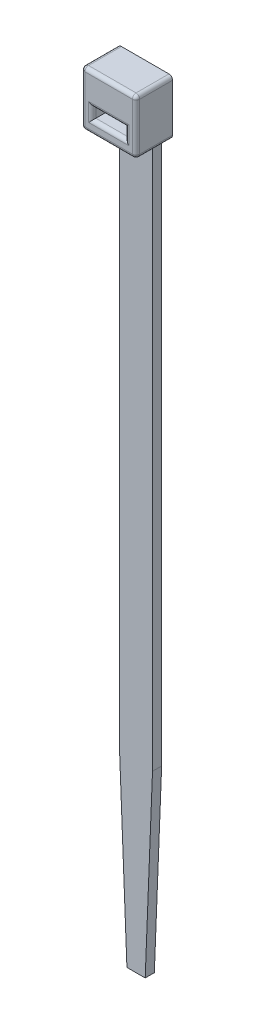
from build123d import *

# Parameters (mm, degrees)
BOSS_EXTRUDE1_DEPTH = 1.27
SKETCH2_W           = 7.62
SKETCH2_H           = 7.62
SKETCH2_W_2         = 4.572
SKETCH2_H_2         = 1.524
BOSS_EXTRUDE2_DEPTH = 5.08
FILLET1_R           = 0.508
CUT_EXTRUDE1_DEPTH  = 1.905
LPATTERN1_COUNT     = 90
LPATTERN1_PITCH     = 0.762


with BuildPart() as part:
    # Sketch1 → Boss-Extrude1 (new body)
    with BuildSketch(Plane.XY):
        Polygon((0, 0), (1.016, -25.4), (3.556, -25.4), (4.572, 0), (4.572, 76.2), (0, 76.2), align=None)
    extrude(amount=BOSS_EXTRUDE1_DEPTH)

    # Sketch2 → Boss-Extrude2 (add)
    with BuildSketch(Plane(origin=(0, 0, 0), x_dir=(-1, 0, 0), z_dir=(0, 0, -1))):
        with Locations((-2.286, 80.01)):
            Rectangle(SKETCH2_W, SKETCH2_H)
        with Locations((-2.286, 78.74)):
            Rectangle(SKETCH2_W_2, SKETCH2_H_2, mode=Mode.SUBTRACT)
    extrude(amount=-BOSS_EXTRUDE2_DEPTH)

    # Fillet1
    fillet1_edges = [part.edges().sort_by_distance(p)[0] for p in [
        (2.286, 76.2, 5.08),
        (-1.524, 76.2, 2.54),
        (6.096, 80.01, 5.08),
        (6.096, 76.2, 2.54),
        (2.286, 83.82, 5.08),
        (6.096, 83.82, 2.54),
        (-1.524, 80.01, 5.08),
        (-1.524, 83.82, 2.54),
        (4.572, 78.74, 5.08),
        (2.286, 77.978, 5.08),
        (0, 78.74, 5.08),
        (2.286, 79.502, 5.08),
    ]]
    fillet(fillet1_edges, radius=FILLET1_R)

    # Sketch3 → Cut-Extrude1 (cut, symmetric)
    with BuildSketch(Plane.ZY.offset(-2.286)):
        Polygon((0, 69.342), (0.254, 69.342), (0, 69.85), align=None)
    cut_extrude1 = extrude(amount=CUT_EXTRUDE1_DEPTH, both=True, mode=Mode.SUBTRACT)

    # LPattern1: Cut-Extrude1 ×90
    with Locations(*[(0, -i * LPATTERN1_PITCH, 0) for i in range(1, LPATTERN1_COUNT)]):
        add(cut_extrude1, mode=Mode.SUBTRACT)


solid = part.part
